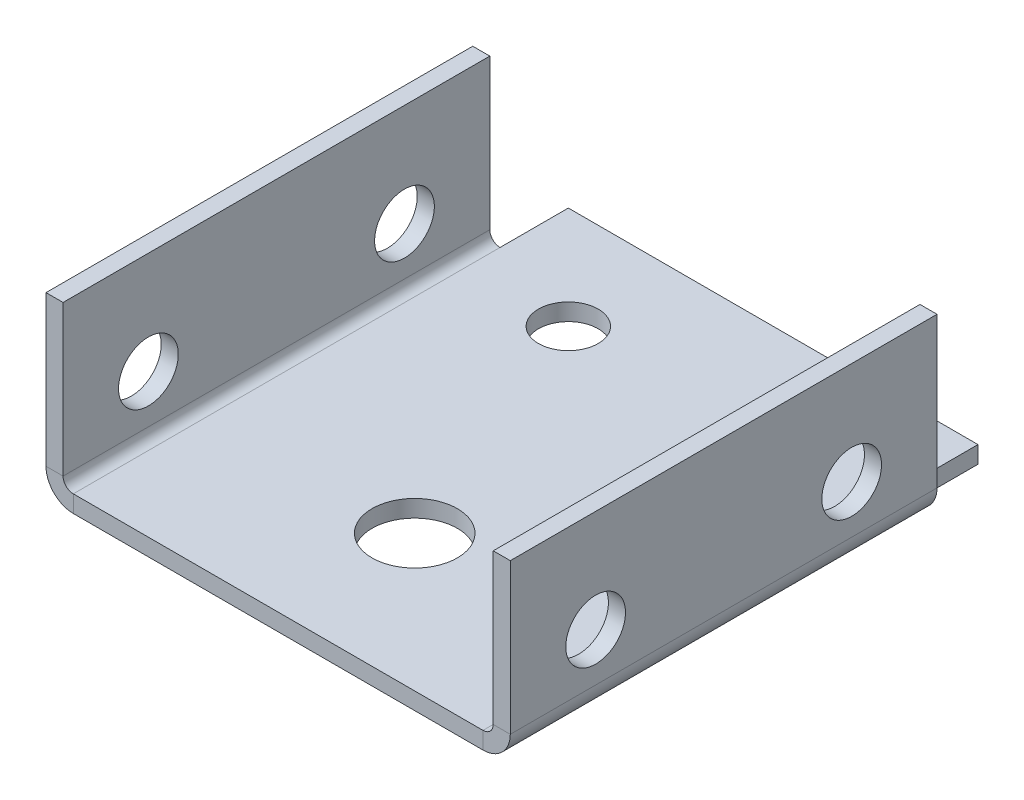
ISO-10303-21;
HEADER;
FILE_DESCRIPTION(('STEP AP214'),'2;1');
FILE_NAME('part.step','',(''),(''),'','','');
FILE_SCHEMA(('AUTOMOTIVE_DESIGN { 1 0 10303 214 1 1 1 1 }'));
ENDSEC;
DATA;
#1=APPLICATION_CONTEXT('core data for automotive mechanical design processes');
#2=APPLICATION_PROTOCOL_DEFINITION('international standard','automotive_design',2000,#1);
#3=PRODUCT_CONTEXT('',#1,'mechanical');
#4=PRODUCT('Part','Part','',(#3));
#5=PRODUCT_RELATED_PRODUCT_CATEGORY('part','',(#4));
#6=PRODUCT_DEFINITION_FORMATION('','',#4);
#7=PRODUCT_DEFINITION_CONTEXT('part definition',#1,'design');
#8=PRODUCT_DEFINITION('design','',#6,#7);
#9=PRODUCT_DEFINITION_SHAPE('','',#8);
#10=(LENGTH_UNIT() NAMED_UNIT(*) SI_UNIT(.MILLI.,.METRE.));
#11=(NAMED_UNIT(*) PLANE_ANGLE_UNIT() SI_UNIT($,.RADIAN.));
#12=(NAMED_UNIT(*) SI_UNIT($,.STERADIAN.) SOLID_ANGLE_UNIT());
#13=UNCERTAINTY_MEASURE_WITH_UNIT(LENGTH_MEASURE(1.E-05),#10,'distance_accuracy_value','');
#14=(GEOMETRIC_REPRESENTATION_CONTEXT(3) GLOBAL_UNCERTAINTY_ASSIGNED_CONTEXT((#13)) GLOBAL_UNIT_ASSIGNED_CONTEXT((#10,
#11,#12)) REPRESENTATION_CONTEXT('',''));
#15=CARTESIAN_POINT('',(0.,0.,0.));
#16=DIRECTION('',(0.,0.,1.));
#17=DIRECTION('',(1.,0.,0.));
#18=AXIS2_PLACEMENT_3D('',#15,#16,#17);
#19=CARTESIAN_POINT('',(0.,0.,-25.));
#20=DIRECTION('',(0.,-1.,0.));
#21=DIRECTION('',(0.,0.,-1.));
#22=AXIS2_PLACEMENT_3D('',#19,#20,#21);
#23=PLANE('',#22);
#24=CARTESIAN_POINT('',(18.,0.,-23.));
#25=DIRECTION('',(0.,1.,0.));
#26=DIRECTION('',(0.,0.,1.));
#27=AXIS2_PLACEMENT_3D('',#24,#25,#26);
#28=CIRCLE('',#27,1.75);
#29=CARTESIAN_POINT('',(18.,0.,-21.25));
#30=VERTEX_POINT('',#29);
#31=EDGE_CURVE('E248',#30,#30,#28,.T.);
#32=ORIENTED_EDGE('',*,*,#31,.T.);
#33=EDGE_LOOP('',(#32));
#34=FACE_BOUND('',#33,.T.);
#35=CARTESIAN_POINT('',(24.,0.,-8.00000000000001));
#36=DIRECTION('',(0.,1.,0.));
#37=DIRECTION('',(0.,0.,1.));
#38=AXIS2_PLACEMENT_3D('',#35,#36,#37);
#39=CIRCLE('',#38,2.5);
#40=CARTESIAN_POINT('',(24.,0.,-5.50000000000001));
#41=VERTEX_POINT('',#40);
#42=EDGE_CURVE('E254',#41,#41,#39,.T.);
#43=ORIENTED_EDGE('',*,*,#42,.T.);
#44=EDGE_LOOP('',(#43));
#45=FACE_BOUND('',#44,.T.);
#46=CARTESIAN_POINT('',(30.,0.,-23.));
#47=DIRECTION('',(0.,1.,0.));
#48=DIRECTION('',(0.,0.,1.));
#49=AXIS2_PLACEMENT_3D('',#46,#47,#48);
#50=CIRCLE('',#49,1.75);
#51=CARTESIAN_POINT('',(30.,0.,-21.25));
#52=VERTEX_POINT('',#51);
#53=EDGE_CURVE('E241',#52,#52,#50,.T.);
#54=ORIENTED_EDGE('',*,*,#53,.T.);
#55=EDGE_LOOP('',(#54));
#56=FACE_BOUND('',#55,.T.);
#57=DIRECTION('',(0.,0.,-1.));
#58=VECTOR('',#57,1.);
#59=CARTESIAN_POINT('',(36.,0.,-29.));
#60=LINE('',#59,#58);
#61=CARTESIAN_POINT('',(36.,0.,-25.));
#62=VERTEX_POINT('',#61);
#63=CARTESIAN_POINT('',(36.,0.,-29.));
#64=VERTEX_POINT('',#63);
#65=EDGE_CURVE('E271',#62,#64,#60,.T.);
#66=ORIENTED_EDGE('',*,*,#65,.F.);
#67=DIRECTION('',(0.,0.,1.));
#68=VECTOR('',#67,1.);
#69=CARTESIAN_POINT('',(36.,0.,-25.));
#70=LINE('',#69,#68);
#71=CARTESIAN_POINT('',(36.,0.,0.));
#72=VERTEX_POINT('',#71);
#73=EDGE_CURVE('E49',#62,#72,#70,.T.);
#74=ORIENTED_EDGE('',*,*,#73,.T.);
#75=DIRECTION('',(1.,0.,0.));
#76=VECTOR('',#75,1.);
#77=CARTESIAN_POINT('',(0.,0.,0.));
#78=LINE('',#77,#76);
#79=CARTESIAN_POINT('',(12.,0.,0.));
#80=VERTEX_POINT('',#79);
#81=EDGE_CURVE('E260',#80,#72,#78,.T.);
#82=ORIENTED_EDGE('',*,*,#81,.F.);
#83=DIRECTION('',(0.,0.,1.));
#84=VECTOR('',#83,1.);
#85=CARTESIAN_POINT('',(12.,0.,-25.));
#86=LINE('',#85,#84);
#87=CARTESIAN_POINT('',(12.,0.,-25.));
#88=VERTEX_POINT('',#87);
#89=EDGE_CURVE('E65',#88,#80,#86,.T.);
#90=ORIENTED_EDGE('',*,*,#89,.F.);
#91=DIRECTION('',(0.,0.,1.));
#92=VECTOR('',#91,1.);
#93=CARTESIAN_POINT('',(12.,0.,-29.));
#94=LINE('',#93,#92);
#95=CARTESIAN_POINT('',(12.,0.,-29.));
#96=VERTEX_POINT('',#95);
#97=EDGE_CURVE('E275',#96,#88,#94,.T.);
#98=ORIENTED_EDGE('',*,*,#97,.F.);
#99=DIRECTION('',(-1.,0.,0.));
#100=VECTOR('',#99,1.);
#101=CARTESIAN_POINT('',(12.,0.,-29.));
#102=LINE('',#101,#100);
#103=EDGE_CURVE('E273',#64,#96,#102,.T.);
#104=ORIENTED_EDGE('',*,*,#103,.F.);
#105=EDGE_LOOP('',(#66,#74,#82,#90,#98,#104));
#106=FACE_BOUND('',#105,.T.);
#107=ADVANCED_FACE('F41',(#34,#45,#56,#106),#23,.T.);
#108=CARTESIAN_POINT('',(0.,1.,0.));
#109=DIRECTION('',(0.,0.,-1.));
#110=DIRECTION('',(-1.,0.,0.));
#111=AXIS2_PLACEMENT_3D('',#108,#109,#110);
#112=PLANE('',#111);
#113=DIRECTION('',(0.,-1.,0.));
#114=VECTOR('',#113,1.);
#115=CARTESIAN_POINT('',(36.,1.,0.));
#116=LINE('',#115,#114);
#117=CARTESIAN_POINT('',(36.,1.,0.));
#118=VERTEX_POINT('',#117);
#119=EDGE_CURVE('E294',#118,#72,#116,.T.);
#120=ORIENTED_EDGE('',*,*,#119,.F.);
#121=DIRECTION('',(1.,0.,0.));
#122=VECTOR('',#121,1.);
#123=CARTESIAN_POINT('',(0.,1.,0.));
#124=LINE('',#123,#122);
#125=CARTESIAN_POINT('',(12.,1.,0.));
#126=VERTEX_POINT('',#125);
#127=EDGE_CURVE('E44',#126,#118,#124,.T.);
#128=ORIENTED_EDGE('',*,*,#127,.F.);
#129=DIRECTION('',(0.,-1.,0.));
#130=VECTOR('',#129,1.);
#131=CARTESIAN_POINT('',(12.,1.,0.));
#132=LINE('',#131,#130);
#133=EDGE_CURVE('E289',#126,#80,#132,.T.);
#134=ORIENTED_EDGE('',*,*,#133,.T.);
#135=ORIENTED_EDGE('',*,*,#81,.T.);
#136=EDGE_LOOP('',(#120,#128,#134,#135));
#137=FACE_BOUND('',#136,.T.);
#138=ADVANCED_FACE('F301',(#137),#112,.F.);
#139=CARTESIAN_POINT('',(0.,1.,-25.));
#140=DIRECTION('',(0.,-1.,0.));
#141=DIRECTION('',(0.,0.,-1.));
#142=AXIS2_PLACEMENT_3D('',#139,#140,#141);
#143=PLANE('',#142);
#144=DIRECTION('',(0.,0.,1.));
#145=VECTOR('',#144,1.);
#146=CARTESIAN_POINT('',(36.,1.,-25.));
#147=LINE('',#146,#145);
#148=CARTESIAN_POINT('',(36.,0.999999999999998,-25.));
#149=VERTEX_POINT('',#148);
#150=EDGE_CURVE('E292',#149,#118,#147,.T.);
#151=ORIENTED_EDGE('',*,*,#150,.F.);
#152=DIRECTION('',(0.,0.,-1.));
#153=VECTOR('',#152,1.);
#154=CARTESIAN_POINT('',(36.,1.,-29.));
#155=LINE('',#154,#153);
#156=CARTESIAN_POINT('',(36.,1.,-29.));
#157=VERTEX_POINT('',#156);
#158=EDGE_CURVE('E263',#149,#157,#155,.T.);
#159=ORIENTED_EDGE('',*,*,#158,.T.);
#160=DIRECTION('',(-1.,0.,0.));
#161=VECTOR('',#160,1.);
#162=CARTESIAN_POINT('',(12.,1.,-29.));
#163=LINE('',#162,#161);
#164=CARTESIAN_POINT('',(12.,1.,-29.));
#165=VERTEX_POINT('',#164);
#166=EDGE_CURVE('E265',#157,#165,#163,.T.);
#167=ORIENTED_EDGE('',*,*,#166,.T.);
#168=DIRECTION('',(0.,0.,1.));
#169=VECTOR('',#168,1.);
#170=CARTESIAN_POINT('',(12.,1.,-29.));
#171=LINE('',#170,#169);
#172=CARTESIAN_POINT('',(12.,1.,-25.));
#173=VERTEX_POINT('',#172);
#174=EDGE_CURVE('E267',#165,#173,#171,.T.);
#175=ORIENTED_EDGE('',*,*,#174,.T.);
#176=DIRECTION('',(0.,0.,1.));
#177=VECTOR('',#176,1.);
#178=CARTESIAN_POINT('',(12.,1.,-25.));
#179=LINE('',#178,#177);
#180=EDGE_CURVE('E283',#173,#126,#179,.T.);
#181=ORIENTED_EDGE('',*,*,#180,.T.);
#182=ORIENTED_EDGE('',*,*,#127,.T.);
#183=EDGE_LOOP('',(#151,#159,#167,#175,#181,#182));
#184=FACE_BOUND('',#183,.T.);
#185=CARTESIAN_POINT('',(18.,1.,-23.));
#186=DIRECTION('',(0.,1.,0.));
#187=DIRECTION('',(0.,0.,1.));
#188=AXIS2_PLACEMENT_3D('',#185,#186,#187);
#189=CIRCLE('',#188,1.75);
#190=CARTESIAN_POINT('',(18.,1.,-21.25));
#191=VERTEX_POINT('',#190);
#192=EDGE_CURVE('E251',#191,#191,#189,.T.);
#193=ORIENTED_EDGE('',*,*,#192,.F.);
#194=EDGE_LOOP('',(#193));
#195=FACE_BOUND('',#194,.T.);
#196=CARTESIAN_POINT('',(24.,1.,-8.00000000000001));
#197=DIRECTION('',(0.,1.,0.));
#198=DIRECTION('',(0.,0.,1.));
#199=AXIS2_PLACEMENT_3D('',#196,#197,#198);
#200=CIRCLE('',#199,2.5);
#201=CARTESIAN_POINT('',(24.,1.,-5.50000000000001));
#202=VERTEX_POINT('',#201);
#203=EDGE_CURVE('E257',#202,#202,#200,.T.);
#204=ORIENTED_EDGE('',*,*,#203,.F.);
#205=EDGE_LOOP('',(#204));
#206=FACE_BOUND('',#205,.T.);
#207=CARTESIAN_POINT('',(30.,1.,-23.));
#208=DIRECTION('',(0.,1.,0.));
#209=DIRECTION('',(0.,0.,1.));
#210=AXIS2_PLACEMENT_3D('',#207,#208,#209);
#211=CIRCLE('',#210,1.75);
#212=CARTESIAN_POINT('',(30.,1.,-21.25));
#213=VERTEX_POINT('',#212);
#214=EDGE_CURVE('E245',#213,#213,#211,.T.);
#215=ORIENTED_EDGE('',*,*,#214,.F.);
#216=EDGE_LOOP('',(#215));
#217=FACE_BOUND('',#216,.T.);
#218=ADVANCED_FACE('F317',(#184,#195,#206,#217),#143,.F.);
#219=CARTESIAN_POINT('',(36.,1.,-29.));
#220=DIRECTION('',(-1.,0.,0.));
#221=DIRECTION('',(0.,0.,1.));
#222=AXIS2_PLACEMENT_3D('',#219,#220,#221);
#223=PLANE('',#222);
#224=ORIENTED_EDGE('',*,*,#65,.T.);
#225=DIRECTION('',(0.,-1.,0.));
#226=VECTOR('',#225,1.);
#227=CARTESIAN_POINT('',(36.,1.,-29.));
#228=LINE('',#227,#226);
#229=EDGE_CURVE('E280',#157,#64,#228,.T.);
#230=ORIENTED_EDGE('',*,*,#229,.F.);
#231=ORIENTED_EDGE('',*,*,#158,.F.);
#232=DIRECTION('',(0.,-1.,0.));
#233=VECTOR('',#232,1.);
#234=CARTESIAN_POINT('',(36.,1.,-25.));
#235=LINE('',#234,#233);
#236=EDGE_CURVE('E12',#149,#62,#235,.T.);
#237=ORIENTED_EDGE('',*,*,#236,.T.);
#238=EDGE_LOOP('',(#224,#230,#231,#237));
#239=FACE_BOUND('',#238,.T.);
#240=ADVANCED_FACE('F343',(#239),#223,.F.);
#241=CARTESIAN_POINT('',(12.,1.,-29.));
#242=DIRECTION('',(0.,0.,1.));
#243=DIRECTION('',(1.,0.,0.));
#244=AXIS2_PLACEMENT_3D('',#241,#242,#243);
#245=PLANE('',#244);
#246=ORIENTED_EDGE('',*,*,#103,.T.);
#247=DIRECTION('',(0.,-1.,0.));
#248=VECTOR('',#247,1.);
#249=CARTESIAN_POINT('',(12.,1.,-29.));
#250=LINE('',#249,#248);
#251=EDGE_CURVE('E270',#165,#96,#250,.T.);
#252=ORIENTED_EDGE('',*,*,#251,.F.);
#253=ORIENTED_EDGE('',*,*,#166,.F.);
#254=ORIENTED_EDGE('',*,*,#229,.T.);
#255=EDGE_LOOP('',(#246,#252,#253,#254));
#256=FACE_BOUND('',#255,.T.);
#257=ADVANCED_FACE('F339',(#256),#245,.F.);
#258=CARTESIAN_POINT('',(12.,1.,-29.));
#259=DIRECTION('',(1.,0.,0.));
#260=DIRECTION('',(0.,0.,-1.));
#261=AXIS2_PLACEMENT_3D('',#258,#259,#260);
#262=PLANE('',#261);
#263=ORIENTED_EDGE('',*,*,#97,.T.);
#264=DIRECTION('',(0.,-1.,0.));
#265=VECTOR('',#264,1.);
#266=CARTESIAN_POINT('',(12.,1.,-25.));
#267=LINE('',#266,#265);
#268=EDGE_CURVE('E286',#173,#88,#267,.T.);
#269=ORIENTED_EDGE('',*,*,#268,.F.);
#270=ORIENTED_EDGE('',*,*,#174,.F.);
#271=ORIENTED_EDGE('',*,*,#251,.T.);
#272=EDGE_LOOP('',(#263,#269,#270,#271));
#273=FACE_BOUND('',#272,.T.);
#274=ADVANCED_FACE('F335',(#273),#262,.F.);
#275=CARTESIAN_POINT('',(24.,1.,-8.00000000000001));
#276=DIRECTION('',(0.,-1.,0.));
#277=DIRECTION('',(0.,0.,-1.));
#278=AXIS2_PLACEMENT_3D('',#275,#276,#277);
#279=CYLINDRICAL_SURFACE('',#278,2.5);
#280=ORIENTED_EDGE('',*,*,#203,.T.);
#281=EDGE_LOOP('',(#280));
#282=FACE_BOUND('',#281,.T.);
#283=ORIENTED_EDGE('',*,*,#42,.F.);
#284=EDGE_LOOP('',(#283));
#285=FACE_BOUND('',#284,.T.);
#286=ADVANCED_FACE('F415',(#282,#285),#279,.F.);
#287=CARTESIAN_POINT('',(18.,1.,-23.));
#288=DIRECTION('',(0.,-1.,0.));
#289=DIRECTION('',(0.,0.,-1.));
#290=AXIS2_PLACEMENT_3D('',#287,#288,#289);
#291=CYLINDRICAL_SURFACE('',#290,1.75);
#292=ORIENTED_EDGE('',*,*,#192,.T.);
#293=EDGE_LOOP('',(#292));
#294=FACE_BOUND('',#293,.T.);
#295=ORIENTED_EDGE('',*,*,#31,.F.);
#296=EDGE_LOOP('',(#295));
#297=FACE_BOUND('',#296,.T.);
#298=ADVANCED_FACE('F407',(#294,#297),#291,.F.);
#299=CARTESIAN_POINT('',(30.,1.,-23.));
#300=DIRECTION('',(0.,-1.,0.));
#301=DIRECTION('',(0.,0.,-1.));
#302=AXIS2_PLACEMENT_3D('',#299,#300,#301);
#303=CYLINDRICAL_SURFACE('',#302,1.75);
#304=ORIENTED_EDGE('',*,*,#214,.T.);
#305=EDGE_LOOP('',(#304));
#306=FACE_BOUND('',#305,.T.);
#307=ORIENTED_EDGE('',*,*,#53,.F.);
#308=EDGE_LOOP('',(#307));
#309=FACE_BOUND('',#308,.T.);
#310=ADVANCED_FACE('F405',(#306,#309),#303,.F.);
#311=CARTESIAN_POINT('',(12.,1.6,-25.));
#312=DIRECTION('',(0.,0.,1.));
#313=DIRECTION('',(1.,0.,0.));
#314=AXIS2_PLACEMENT_3D('',#311,#312,#313);
#315=PLANE('',#314);
#316=ORIENTED_EDGE('',*,*,#268,.T.);
#317=CARTESIAN_POINT('',(12.,1.6,-25.));
#318=DIRECTION('',(0.,0.,1.));
#319=DIRECTION('',(1.,0.,0.));
#320=AXIS2_PLACEMENT_3D('',#317,#318,#319);
#321=CIRCLE('',#320,1.6);
#322=CARTESIAN_POINT('',(10.4,1.60000000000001,-25.));
#323=VERTEX_POINT('',#322);
#324=EDGE_CURVE('E191',#88,#323,#321,.F.);
#325=ORIENTED_EDGE('',*,*,#324,.T.);
#326=DIRECTION('',(1.,0.,0.));
#327=VECTOR('',#326,1.);
#328=CARTESIAN_POINT('',(11.4,1.6,-25.));
#329=LINE('',#328,#327);
#330=CARTESIAN_POINT('',(11.4,1.6,-25.));
#331=VERTEX_POINT('',#330);
#332=EDGE_CURVE('E226',#323,#331,#329,.T.);
#333=ORIENTED_EDGE('',*,*,#332,.T.);
#334=CARTESIAN_POINT('',(12.,1.6,-25.));
#335=DIRECTION('',(0.,0.,-1.));
#336=DIRECTION('',(-1.,0.,0.));
#337=AXIS2_PLACEMENT_3D('',#334,#335,#336);
#338=CIRCLE('',#337,0.6);
#339=EDGE_CURVE('E234',#173,#331,#338,.T.);
#340=ORIENTED_EDGE('',*,*,#339,.F.);
#341=EDGE_LOOP('',(#316,#325,#333,#340));
#342=FACE_BOUND('',#341,.T.);
#343=ADVANCED_FACE('F332',(#342),#315,.F.);
#344=CARTESIAN_POINT('',(12.,1.6,0.));
#345=DIRECTION('',(0.,0.,-1.));
#346=DIRECTION('',(0.,1.,0.));
#347=AXIS2_PLACEMENT_3D('',#344,#345,#346);
#348=PLANE('',#347);
#349=DIRECTION('',(-1.,0.,0.));
#350=VECTOR('',#349,1.);
#351=CARTESIAN_POINT('',(11.4,1.6,0.));
#352=LINE('',#351,#350);
#353=CARTESIAN_POINT('',(11.4,1.6,0.));
#354=VERTEX_POINT('',#353);
#355=CARTESIAN_POINT('',(10.4,1.60000000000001,0.));
#356=VERTEX_POINT('',#355);
#357=EDGE_CURVE('E229',#354,#356,#352,.T.);
#358=ORIENTED_EDGE('',*,*,#357,.T.);
#359=CARTESIAN_POINT('',(12.,1.6,0.));
#360=DIRECTION('',(0.,0.,1.));
#361=DIRECTION('',(1.,0.,0.));
#362=AXIS2_PLACEMENT_3D('',#359,#360,#361);
#363=CIRCLE('',#362,1.6);
#364=EDGE_CURVE('E238',#356,#80,#363,.T.);
#365=ORIENTED_EDGE('',*,*,#364,.T.);
#366=ORIENTED_EDGE('',*,*,#133,.F.);
#367=CARTESIAN_POINT('',(12.,1.6,0.));
#368=DIRECTION('',(0.,0.,1.));
#369=DIRECTION('',(0.,-1.,0.));
#370=AXIS2_PLACEMENT_3D('',#367,#368,#369);
#371=CIRCLE('',#370,0.6);
#372=EDGE_CURVE('E237',#354,#126,#371,.T.);
#373=ORIENTED_EDGE('',*,*,#372,.F.);
#374=EDGE_LOOP('',(#358,#365,#366,#373));
#375=FACE_BOUND('',#374,.T.);
#376=ADVANCED_FACE('F327',(#375),#348,.F.);
#377=CARTESIAN_POINT('',(12.,1.6,-37.7225315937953));
#378=DIRECTION('',(0.,0.,1.));
#379=DIRECTION('',(1.,0.,0.));
#380=AXIS2_PLACEMENT_3D('',#377,#378,#379);
#381=CYLINDRICAL_SURFACE('',#380,0.6);
#382=ORIENTED_EDGE('',*,*,#372,.T.);
#383=ORIENTED_EDGE('',*,*,#180,.F.);
#384=ORIENTED_EDGE('',*,*,#339,.T.);
#385=DIRECTION('',(0.,0.,1.));
#386=VECTOR('',#385,1.);
#387=CARTESIAN_POINT('',(11.4,1.6,-25.));
#388=LINE('',#387,#386);
#389=EDGE_CURVE('E184',#331,#354,#388,.T.);
#390=ORIENTED_EDGE('',*,*,#389,.T.);
#391=EDGE_LOOP('',(#382,#383,#384,#390));
#392=FACE_BOUND('',#391,.T.);
#393=ADVANCED_FACE('F324',(#392),#381,.F.);
#394=CARTESIAN_POINT('',(12.,1.6,-37.7225315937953));
#395=DIRECTION('',(0.,0.,1.));
#396=DIRECTION('',(1.,0.,0.));
#397=AXIS2_PLACEMENT_3D('',#394,#395,#396);
#398=CYLINDRICAL_SURFACE('',#397,1.6);
#399=ORIENTED_EDGE('',*,*,#364,.F.);
#400=DIRECTION('',(0.,0.,1.));
#401=VECTOR('',#400,1.);
#402=CARTESIAN_POINT('',(10.4,1.60000000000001,-25.));
#403=LINE('',#402,#401);
#404=EDGE_CURVE('E195',#323,#356,#403,.T.);
#405=ORIENTED_EDGE('',*,*,#404,.F.);
#406=ORIENTED_EDGE('',*,*,#324,.F.);
#407=ORIENTED_EDGE('',*,*,#89,.T.);
#408=EDGE_LOOP('',(#399,#405,#406,#407));
#409=FACE_BOUND('',#408,.T.);
#410=ADVANCED_FACE('F329',(#409),#398,.T.);
#411=CARTESIAN_POINT('',(11.4,4.40999999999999,-5.));
#412=DIRECTION('',(-1.,0.,0.));
#413=DIRECTION('',(0.,0.,-1.));
#414=AXIS2_PLACEMENT_3D('',#411,#412,#413);
#415=CYLINDRICAL_SURFACE('',#414,1.75);
#416=CARTESIAN_POINT('',(11.4,4.40999999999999,-5.));
#417=DIRECTION('',(1.,0.,0.));
#418=DIRECTION('',(0.,0.,1.));
#419=AXIS2_PLACEMENT_3D('',#416,#417,#418);
#420=CIRCLE('',#419,1.75);
#421=CARTESIAN_POINT('',(11.4,4.40999999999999,-3.25));
#422=VERTEX_POINT('',#421);
#423=EDGE_CURVE('E223',#422,#422,#420,.T.);
#424=ORIENTED_EDGE('',*,*,#423,.T.);
#425=EDGE_LOOP('',(#424));
#426=FACE_BOUND('',#425,.T.);
#427=CARTESIAN_POINT('',(10.4,4.40999999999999,-5.));
#428=DIRECTION('',(1.,0.,0.));
#429=DIRECTION('',(0.,0.,1.));
#430=AXIS2_PLACEMENT_3D('',#427,#428,#429);
#431=CIRCLE('',#430,1.75);
#432=CARTESIAN_POINT('',(10.4,4.40999999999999,-3.25));
#433=VERTEX_POINT('',#432);
#434=EDGE_CURVE('E198',#433,#433,#431,.T.);
#435=ORIENTED_EDGE('',*,*,#434,.F.);
#436=EDGE_LOOP('',(#435));
#437=FACE_BOUND('',#436,.T.);
#438=ADVANCED_FACE('F506',(#426,#437),#415,.F.);
#439=CARTESIAN_POINT('',(11.4,4.40999999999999,-20.));
#440=DIRECTION('',(-1.,0.,0.));
#441=DIRECTION('',(0.,0.,-1.));
#442=AXIS2_PLACEMENT_3D('',#439,#440,#441);
#443=CYLINDRICAL_SURFACE('',#442,1.75);
#444=CARTESIAN_POINT('',(11.4,4.40999999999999,-20.));
#445=DIRECTION('',(1.,0.,0.));
#446=DIRECTION('',(0.,0.,1.));
#447=AXIS2_PLACEMENT_3D('',#444,#445,#446);
#448=CIRCLE('',#447,1.75);
#449=CARTESIAN_POINT('',(11.4,4.40999999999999,-18.25));
#450=VERTEX_POINT('',#449);
#451=EDGE_CURVE('E220',#450,#450,#448,.T.);
#452=ORIENTED_EDGE('',*,*,#451,.T.);
#453=EDGE_LOOP('',(#452));
#454=FACE_BOUND('',#453,.T.);
#455=CARTESIAN_POINT('',(10.4,4.40999999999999,-20.));
#456=DIRECTION('',(1.,0.,0.));
#457=DIRECTION('',(0.,0.,1.));
#458=AXIS2_PLACEMENT_3D('',#455,#456,#457);
#459=CIRCLE('',#458,1.75);
#460=CARTESIAN_POINT('',(10.4,4.40999999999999,-18.25));
#461=VERTEX_POINT('',#460);
#462=EDGE_CURVE('E201',#461,#461,#459,.T.);
#463=ORIENTED_EDGE('',*,*,#462,.F.);
#464=EDGE_LOOP('',(#463));
#465=FACE_BOUND('',#464,.T.);
#466=ADVANCED_FACE('F515',(#454,#465),#443,.F.);
#467=CARTESIAN_POINT('',(11.4,10.41,0.));
#468=DIRECTION('',(0.,-1.,0.));
#469=DIRECTION('',(0.,0.,-1.));
#470=AXIS2_PLACEMENT_3D('',#467,#468,#469);
#471=PLANE('',#470);
#472=DIRECTION('',(0.,0.,1.));
#473=VECTOR('',#472,1.);
#474=CARTESIAN_POINT('',(10.4,10.41,0.));
#475=LINE('',#474,#473);
#476=CARTESIAN_POINT('',(10.4,10.41,-25.));
#477=VERTEX_POINT('',#476);
#478=CARTESIAN_POINT('',(10.4,10.41,0.));
#479=VERTEX_POINT('',#478);
#480=EDGE_CURVE('E217',#477,#479,#475,.T.);
#481=ORIENTED_EDGE('',*,*,#480,.T.);
#482=DIRECTION('',(-1.,0.,0.));
#483=VECTOR('',#482,1.);
#484=CARTESIAN_POINT('',(11.4,10.41,0.));
#485=LINE('',#484,#483);
#486=CARTESIAN_POINT('',(11.4,10.41,0.));
#487=VERTEX_POINT('',#486);
#488=EDGE_CURVE('E192',#487,#479,#485,.T.);
#489=ORIENTED_EDGE('',*,*,#488,.F.);
#490=DIRECTION('',(0.,0.,1.));
#491=VECTOR('',#490,1.);
#492=CARTESIAN_POINT('',(11.4,10.41,0.));
#493=LINE('',#492,#491);
#494=CARTESIAN_POINT('',(11.4,10.41,-25.));
#495=VERTEX_POINT('',#494);
#496=EDGE_CURVE('E209',#495,#487,#493,.T.);
#497=ORIENTED_EDGE('',*,*,#496,.F.);
#498=DIRECTION('',(-1.,0.,0.));
#499=VECTOR('',#498,1.);
#500=CARTESIAN_POINT('',(11.4,10.41,-25.));
#501=LINE('',#500,#499);
#502=EDGE_CURVE('E214',#495,#477,#501,.T.);
#503=ORIENTED_EDGE('',*,*,#502,.T.);
#504=EDGE_LOOP('',(#481,#489,#497,#503));
#505=FACE_BOUND('',#504,.T.);
#506=ADVANCED_FACE('F525',(#505),#471,.F.);
#507=CARTESIAN_POINT('',(11.4,10.41,-25.));
#508=DIRECTION('',(-1.,0.,0.));
#509=DIRECTION('',(0.,0.,-1.));
#510=AXIS2_PLACEMENT_3D('',#507,#508,#509);
#511=PLANE('',#510);
#512=ORIENTED_EDGE('',*,*,#389,.F.);
#513=DIRECTION('',(0.,1.,0.));
#514=VECTOR('',#513,1.);
#515=CARTESIAN_POINT('',(11.4,10.41,-25.));
#516=LINE('',#515,#514);
#517=EDGE_CURVE('E212',#331,#495,#516,.T.);
#518=ORIENTED_EDGE('',*,*,#517,.T.);
#519=ORIENTED_EDGE('',*,*,#496,.T.);
#520=DIRECTION('',(0.,-1.,0.));
#521=VECTOR('',#520,1.);
#522=CARTESIAN_POINT('',(11.4,10.41,0.));
#523=LINE('',#522,#521);
#524=EDGE_CURVE('E206',#487,#354,#523,.T.);
#525=ORIENTED_EDGE('',*,*,#524,.T.);
#526=EDGE_LOOP('',(#512,#518,#519,#525));
#527=FACE_BOUND('',#526,.T.);
#528=ORIENTED_EDGE('',*,*,#451,.F.);
#529=EDGE_LOOP('',(#528));
#530=FACE_BOUND('',#529,.T.);
#531=ORIENTED_EDGE('',*,*,#423,.F.);
#532=EDGE_LOOP('',(#531));
#533=FACE_BOUND('',#532,.T.);
#534=ADVANCED_FACE('F535',(#527,#530,#533),#511,.F.);
#535=CARTESIAN_POINT('',(11.4,10.41,-25.));
#536=DIRECTION('',(0.,0.,1.));
#537=DIRECTION('',(0.,-1.,0.));
#538=AXIS2_PLACEMENT_3D('',#535,#536,#537);
#539=PLANE('',#538);
#540=ORIENTED_EDGE('',*,*,#332,.F.);
#541=DIRECTION('',(0.,1.,0.));
#542=VECTOR('',#541,1.);
#543=CARTESIAN_POINT('',(10.4,10.41,-25.));
#544=LINE('',#543,#542);
#545=EDGE_CURVE('E204',#323,#477,#544,.T.);
#546=ORIENTED_EDGE('',*,*,#545,.T.);
#547=ORIENTED_EDGE('',*,*,#502,.F.);
#548=ORIENTED_EDGE('',*,*,#517,.F.);
#549=EDGE_LOOP('',(#540,#546,#547,#548));
#550=FACE_BOUND('',#549,.T.);
#551=ADVANCED_FACE('F545',(#550),#539,.F.);
#552=CARTESIAN_POINT('',(10.4,10.41,-25.));
#553=DIRECTION('',(-1.,0.,0.));
#554=DIRECTION('',(0.,0.,-1.));
#555=AXIS2_PLACEMENT_3D('',#552,#553,#554);
#556=PLANE('',#555);
#557=ORIENTED_EDGE('',*,*,#462,.T.);
#558=EDGE_LOOP('',(#557));
#559=FACE_BOUND('',#558,.T.);
#560=ORIENTED_EDGE('',*,*,#434,.T.);
#561=EDGE_LOOP('',(#560));
#562=FACE_BOUND('',#561,.T.);
#563=ORIENTED_EDGE('',*,*,#545,.F.);
#564=ORIENTED_EDGE('',*,*,#404,.T.);
#565=DIRECTION('',(0.,-1.,0.));
#566=VECTOR('',#565,1.);
#567=CARTESIAN_POINT('',(10.4,10.41,0.));
#568=LINE('',#567,#566);
#569=EDGE_CURVE('E189',#479,#356,#568,.T.);
#570=ORIENTED_EDGE('',*,*,#569,.F.);
#571=ORIENTED_EDGE('',*,*,#480,.F.);
#572=EDGE_LOOP('',(#563,#564,#570,#571));
#573=FACE_BOUND('',#572,.T.);
#574=ADVANCED_FACE('F555',(#559,#562,#573),#556,.T.);
#575=CARTESIAN_POINT('',(11.4,10.41,0.));
#576=DIRECTION('',(0.,0.,-1.));
#577=DIRECTION('',(0.,1.,0.));
#578=AXIS2_PLACEMENT_3D('',#575,#576,#577);
#579=PLANE('',#578);
#580=ORIENTED_EDGE('',*,*,#357,.F.);
#581=ORIENTED_EDGE('',*,*,#524,.F.);
#582=ORIENTED_EDGE('',*,*,#488,.T.);
#583=ORIENTED_EDGE('',*,*,#569,.T.);
#584=EDGE_LOOP('',(#580,#581,#582,#583));
#585=FACE_BOUND('',#584,.T.);
#586=ADVANCED_FACE('F565',(#585),#579,.F.);
#587=CARTESIAN_POINT('',(36.,1.6,-25.));
#588=DIRECTION('',(0.,0.,1.));
#589=DIRECTION('',(1.,0.,0.));
#590=AXIS2_PLACEMENT_3D('',#587,#588,#589);
#591=PLANE('',#590);
#592=DIRECTION('',(-1.,0.,0.));
#593=VECTOR('',#592,1.);
#594=CARTESIAN_POINT('',(36.6,1.6,-25.));
#595=LINE('',#594,#593);
#596=CARTESIAN_POINT('',(37.6,1.60000000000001,-25.));
#597=VERTEX_POINT('',#596);
#598=CARTESIAN_POINT('',(36.6,1.6,-25.));
#599=VERTEX_POINT('',#598);
#600=EDGE_CURVE('E373',#597,#599,#595,.T.);
#601=ORIENTED_EDGE('',*,*,#600,.F.);
#602=CARTESIAN_POINT('',(36.,1.6,-25.));
#603=DIRECTION('',(0.,0.,-1.));
#604=DIRECTION('',(-1.,0.,0.));
#605=AXIS2_PLACEMENT_3D('',#602,#603,#604);
#606=CIRCLE('',#605,1.6);
#607=EDGE_CURVE('E57',#597,#62,#606,.T.);
#608=ORIENTED_EDGE('',*,*,#607,.T.);
#609=ORIENTED_EDGE('',*,*,#236,.F.);
#610=CARTESIAN_POINT('',(36.,1.6,-25.));
#611=DIRECTION('',(0.,0.,-1.));
#612=DIRECTION('',(-1.,0.,0.));
#613=AXIS2_PLACEMENT_3D('',#610,#611,#612);
#614=CIRCLE('',#613,0.600000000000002);
#615=EDGE_CURVE('E177',#599,#149,#614,.T.);
#616=ORIENTED_EDGE('',*,*,#615,.F.);
#617=EDGE_LOOP('',(#601,#608,#609,#616));
#618=FACE_BOUND('',#617,.T.);
#619=ADVANCED_FACE('F345',(#618),#591,.F.);
#620=CARTESIAN_POINT('',(36.,1.6,0.));
#621=DIRECTION('',(0.,0.,-1.));
#622=DIRECTION('',(-1.,0.,0.));
#623=AXIS2_PLACEMENT_3D('',#620,#621,#622);
#624=PLANE('',#623);
#625=CARTESIAN_POINT('',(36.,1.6,0.));
#626=DIRECTION('',(0.,0.,-1.));
#627=DIRECTION('',(-1.,0.,0.));
#628=AXIS2_PLACEMENT_3D('',#625,#626,#627);
#629=CIRCLE('',#628,1.6);
#630=CARTESIAN_POINT('',(37.6,1.60000000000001,0.));
#631=VERTEX_POINT('',#630);
#632=EDGE_CURVE('E181',#72,#631,#629,.F.);
#633=ORIENTED_EDGE('',*,*,#632,.T.);
#634=DIRECTION('',(1.,0.,0.));
#635=VECTOR('',#634,1.);
#636=CARTESIAN_POINT('',(36.6,1.6,0.));
#637=LINE('',#636,#635);
#638=CARTESIAN_POINT('',(36.6,1.6,0.));
#639=VERTEX_POINT('',#638);
#640=EDGE_CURVE('E153',#639,#631,#637,.T.);
#641=ORIENTED_EDGE('',*,*,#640,.F.);
#642=CARTESIAN_POINT('',(36.,1.6,0.));
#643=DIRECTION('',(0.,0.,1.));
#644=DIRECTION('',(1.,0.,0.));
#645=AXIS2_PLACEMENT_3D('',#642,#643,#644);
#646=CIRCLE('',#645,0.600000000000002);
#647=EDGE_CURVE('E180',#118,#639,#646,.T.);
#648=ORIENTED_EDGE('',*,*,#647,.F.);
#649=ORIENTED_EDGE('',*,*,#119,.T.);
#650=EDGE_LOOP('',(#633,#641,#648,#649));
#651=FACE_BOUND('',#650,.T.);
#652=ADVANCED_FACE('F310',(#651),#624,.F.);
#653=CARTESIAN_POINT('',(36.,1.6,12.7225315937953));
#654=DIRECTION('',(0.,0.,-1.));
#655=DIRECTION('',(-1.,0.,0.));
#656=AXIS2_PLACEMENT_3D('',#653,#654,#655);
#657=CYLINDRICAL_SURFACE('',#656,0.6);
#658=ORIENTED_EDGE('',*,*,#150,.T.);
#659=ORIENTED_EDGE('',*,*,#647,.T.);
#660=DIRECTION('',(0.,0.,1.));
#661=VECTOR('',#660,1.);
#662=CARTESIAN_POINT('',(36.6,1.6,-25.));
#663=LINE('',#662,#661);
#664=EDGE_CURVE('E347',#599,#639,#663,.T.);
#665=ORIENTED_EDGE('',*,*,#664,.F.);
#666=ORIENTED_EDGE('',*,*,#615,.T.);
#667=EDGE_LOOP('',(#658,#659,#665,#666));
#668=FACE_BOUND('',#667,.T.);
#669=ADVANCED_FACE('F346',(#668),#657,.F.);
#670=CARTESIAN_POINT('',(36.,1.6,12.7225315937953));
#671=DIRECTION('',(0.,0.,-1.));
#672=DIRECTION('',(-1.,0.,0.));
#673=AXIS2_PLACEMENT_3D('',#670,#671,#672);
#674=CYLINDRICAL_SURFACE('',#673,1.6);
#675=ORIENTED_EDGE('',*,*,#73,.F.);
#676=ORIENTED_EDGE('',*,*,#607,.F.);
#677=DIRECTION('',(0.,0.,1.));
#678=VECTOR('',#677,1.);
#679=CARTESIAN_POINT('',(37.6,1.60000000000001,-25.));
#680=LINE('',#679,#678);
#681=EDGE_CURVE('E172',#597,#631,#680,.T.);
#682=ORIENTED_EDGE('',*,*,#681,.T.);
#683=ORIENTED_EDGE('',*,*,#632,.F.);
#684=EDGE_LOOP('',(#675,#676,#682,#683));
#685=FACE_BOUND('',#684,.T.);
#686=ADVANCED_FACE('F308',(#685),#674,.T.);
#687=CARTESIAN_POINT('',(36.6,10.41,0.));
#688=DIRECTION('',(0.,-1.,0.));
#689=DIRECTION('',(0.,0.,1.));
#690=AXIS2_PLACEMENT_3D('',#687,#688,#689);
#691=PLANE('',#690);
#692=DIRECTION('',(0.,0.,-1.));
#693=VECTOR('',#692,1.);
#694=CARTESIAN_POINT('',(37.6,10.41,0.));
#695=LINE('',#694,#693);
#696=CARTESIAN_POINT('',(37.6,10.41,0.));
#697=VERTEX_POINT('',#696);
#698=CARTESIAN_POINT('',(37.6,10.41,-25.));
#699=VERTEX_POINT('',#698);
#700=EDGE_CURVE('E163',#697,#699,#695,.T.);
#701=ORIENTED_EDGE('',*,*,#700,.T.);
#702=DIRECTION('',(1.,0.,0.));
#703=VECTOR('',#702,1.);
#704=CARTESIAN_POINT('',(36.6,10.41,-25.));
#705=LINE('',#704,#703);
#706=CARTESIAN_POINT('',(36.6,10.41,-25.));
#707=VERTEX_POINT('',#706);
#708=EDGE_CURVE('E186',#707,#699,#705,.T.);
#709=ORIENTED_EDGE('',*,*,#708,.F.);
#710=DIRECTION('',(0.,0.,-1.));
#711=VECTOR('',#710,1.);
#712=CARTESIAN_POINT('',(36.6,10.41,0.));
#713=LINE('',#712,#711);
#714=CARTESIAN_POINT('',(36.6,10.41,0.));
#715=VERTEX_POINT('',#714);
#716=EDGE_CURVE('E165',#715,#707,#713,.T.);
#717=ORIENTED_EDGE('',*,*,#716,.F.);
#718=DIRECTION('',(1.,0.,0.));
#719=VECTOR('',#718,1.);
#720=CARTESIAN_POINT('',(36.6,10.41,0.));
#721=LINE('',#720,#719);
#722=EDGE_CURVE('E150',#715,#697,#721,.T.);
#723=ORIENTED_EDGE('',*,*,#722,.T.);
#724=EDGE_LOOP('',(#701,#709,#717,#723));
#725=FACE_BOUND('',#724,.T.);
#726=ADVANCED_FACE('F161',(#725),#691,.F.);
#727=CARTESIAN_POINT('',(36.6,4.41,-20.));
#728=DIRECTION('',(1.,0.,0.));
#729=DIRECTION('',(0.,0.,-1.));
#730=AXIS2_PLACEMENT_3D('',#727,#728,#729);
#731=CYLINDRICAL_SURFACE('',#730,1.75);
#732=CARTESIAN_POINT('',(36.6,4.41,-20.));
#733=DIRECTION('',(-1.,0.,0.));
#734=DIRECTION('',(0.,0.,1.));
#735=AXIS2_PLACEMENT_3D('',#732,#733,#734);
#736=CIRCLE('',#735,1.75);
#737=CARTESIAN_POINT('',(36.6,4.41,-18.25));
#738=VERTEX_POINT('',#737);
#739=EDGE_CURVE('E166',#738,#738,#736,.T.);
#740=ORIENTED_EDGE('',*,*,#739,.T.);
#741=EDGE_LOOP('',(#740));
#742=FACE_BOUND('',#741,.T.);
#743=CARTESIAN_POINT('',(37.6,4.41,-20.));
#744=DIRECTION('',(-1.,0.,0.));
#745=DIRECTION('',(0.,0.,1.));
#746=AXIS2_PLACEMENT_3D('',#743,#744,#745);
#747=CIRCLE('',#746,1.75);
#748=CARTESIAN_POINT('',(37.6,4.41,-18.25));
#749=VERTEX_POINT('',#748);
#750=EDGE_CURVE('E158',#749,#749,#747,.T.);
#751=ORIENTED_EDGE('',*,*,#750,.F.);
#752=EDGE_LOOP('',(#751));
#753=FACE_BOUND('',#752,.T.);
#754=ADVANCED_FACE('F362',(#742,#753),#731,.F.);
#755=CARTESIAN_POINT('',(36.6,4.41,-5.));
#756=DIRECTION('',(1.,0.,0.));
#757=DIRECTION('',(0.,0.,-1.));
#758=AXIS2_PLACEMENT_3D('',#755,#756,#757);
#759=CYLINDRICAL_SURFACE('',#758,1.75);
#760=CARTESIAN_POINT('',(36.6,4.41,-5.));
#761=DIRECTION('',(-1.,0.,0.));
#762=DIRECTION('',(0.,0.,1.));
#763=AXIS2_PLACEMENT_3D('',#760,#761,#762);
#764=CIRCLE('',#763,1.75);
#765=CARTESIAN_POINT('',(36.6,4.41,-3.25));
#766=VERTEX_POINT('',#765);
#767=EDGE_CURVE('E354',#766,#766,#764,.T.);
#768=ORIENTED_EDGE('',*,*,#767,.T.);
#769=EDGE_LOOP('',(#768));
#770=FACE_BOUND('',#769,.T.);
#771=CARTESIAN_POINT('',(37.6,4.41,-5.));
#772=DIRECTION('',(-1.,0.,0.));
#773=DIRECTION('',(0.,0.,1.));
#774=AXIS2_PLACEMENT_3D('',#771,#772,#773);
#775=CIRCLE('',#774,1.75);
#776=CARTESIAN_POINT('',(37.6,4.41,-3.25));
#777=VERTEX_POINT('',#776);
#778=EDGE_CURVE('E376',#777,#777,#775,.T.);
#779=ORIENTED_EDGE('',*,*,#778,.F.);
#780=EDGE_LOOP('',(#779));
#781=FACE_BOUND('',#780,.T.);
#782=ADVANCED_FACE('F367',(#770,#781),#759,.F.);
#783=CARTESIAN_POINT('',(36.6000000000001,-37.59,-25.));
#784=DIRECTION('',(1.,0.,0.));
#785=DIRECTION('',(0.,0.,-1.));
#786=AXIS2_PLACEMENT_3D('',#783,#784,#785);
#787=PLANE('',#786);
#788=ORIENTED_EDGE('',*,*,#767,.F.);
#789=EDGE_LOOP('',(#788));
#790=FACE_BOUND('',#789,.T.);
#791=ORIENTED_EDGE('',*,*,#739,.F.);
#792=EDGE_LOOP('',(#791));
#793=FACE_BOUND('',#792,.T.);
#794=DIRECTION('',(0.,-1.,0.));
#795=VECTOR('',#794,1.);
#796=CARTESIAN_POINT('',(36.6,-1.59000000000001,-25.));
#797=LINE('',#796,#795);
#798=EDGE_CURVE('E351',#707,#599,#797,.T.);
#799=ORIENTED_EDGE('',*,*,#798,.T.);
#800=ORIENTED_EDGE('',*,*,#664,.T.);
#801=DIRECTION('',(0.,1.,0.));
#802=VECTOR('',#801,1.);
#803=CARTESIAN_POINT('',(36.6000000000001,-37.59,0.));
#804=LINE('',#803,#802);
#805=EDGE_CURVE('E350',#639,#715,#804,.T.);
#806=ORIENTED_EDGE('',*,*,#805,.T.);
#807=ORIENTED_EDGE('',*,*,#716,.T.);
#808=EDGE_LOOP('',(#799,#800,#806,#807));
#809=FACE_BOUND('',#808,.T.);
#810=ADVANCED_FACE('F365',(#790,#793,#809),#787,.F.);
#811=CARTESIAN_POINT('',(36.6000000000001,-37.59,0.));
#812=DIRECTION('',(0.,0.,-1.));
#813=DIRECTION('',(0.,-1.,0.));
#814=AXIS2_PLACEMENT_3D('',#811,#812,#813);
#815=PLANE('',#814);
#816=ORIENTED_EDGE('',*,*,#805,.F.);
#817=ORIENTED_EDGE('',*,*,#640,.T.);
#818=DIRECTION('',(0.,1.,0.));
#819=VECTOR('',#818,1.);
#820=CARTESIAN_POINT('',(37.6000000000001,-37.59,0.));
#821=LINE('',#820,#819);
#822=EDGE_CURVE('E146',#631,#697,#821,.T.);
#823=ORIENTED_EDGE('',*,*,#822,.T.);
#824=ORIENTED_EDGE('',*,*,#722,.F.);
#825=EDGE_LOOP('',(#816,#817,#823,#824));
#826=FACE_BOUND('',#825,.T.);
#827=ADVANCED_FACE('F149',(#826),#815,.F.);
#828=CARTESIAN_POINT('',(37.6000000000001,-37.59,-25.));
#829=DIRECTION('',(1.,0.,0.));
#830=DIRECTION('',(0.,0.,-1.));
#831=AXIS2_PLACEMENT_3D('',#828,#829,#830);
#832=PLANE('',#831);
#833=ORIENTED_EDGE('',*,*,#681,.F.);
#834=DIRECTION('',(0.,-1.,0.));
#835=VECTOR('',#834,1.);
#836=CARTESIAN_POINT('',(37.6,-1.59,-25.));
#837=LINE('',#836,#835);
#838=EDGE_CURVE('E171',#699,#597,#837,.T.);
#839=ORIENTED_EDGE('',*,*,#838,.F.);
#840=ORIENTED_EDGE('',*,*,#700,.F.);
#841=ORIENTED_EDGE('',*,*,#822,.F.);
#842=EDGE_LOOP('',(#833,#839,#840,#841));
#843=FACE_BOUND('',#842,.T.);
#844=ORIENTED_EDGE('',*,*,#750,.T.);
#845=EDGE_LOOP('',(#844));
#846=FACE_BOUND('',#845,.T.);
#847=ORIENTED_EDGE('',*,*,#778,.T.);
#848=EDGE_LOOP('',(#847));
#849=FACE_BOUND('',#848,.T.);
#850=ADVANCED_FACE('F169',(#843,#846,#849),#832,.T.);
#851=CARTESIAN_POINT('',(36.6,-1.59000000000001,-25.));
#852=DIRECTION('',(0.,0.,1.));
#853=DIRECTION('',(0.,1.,0.));
#854=AXIS2_PLACEMENT_3D('',#851,#852,#853);
#855=PLANE('',#854);
#856=ORIENTED_EDGE('',*,*,#838,.T.);
#857=ORIENTED_EDGE('',*,*,#600,.T.);
#858=ORIENTED_EDGE('',*,*,#798,.F.);
#859=ORIENTED_EDGE('',*,*,#708,.T.);
#860=EDGE_LOOP('',(#856,#857,#858,#859));
#861=FACE_BOUND('',#860,.T.);
#862=ADVANCED_FACE('F372',(#861),#855,.F.);
#863=CLOSED_SHELL('',(#107,#138,#218,#240,#257,#274,#286,#298,#310,#343,#376,#393,#410,#438,
#466,#506,#534,#551,#574,#586,#619,#652,#669,#686,#726,#754,#782,#810,#827,#850,#862));
#864=MANIFOLD_SOLID_BREP('B2',#863);
#865=ADVANCED_BREP_SHAPE_REPRESENTATION('',(#18,#864),#14);
#866=SHAPE_DEFINITION_REPRESENTATION(#9,#865);
ENDSEC;
END-ISO-10303-21;
